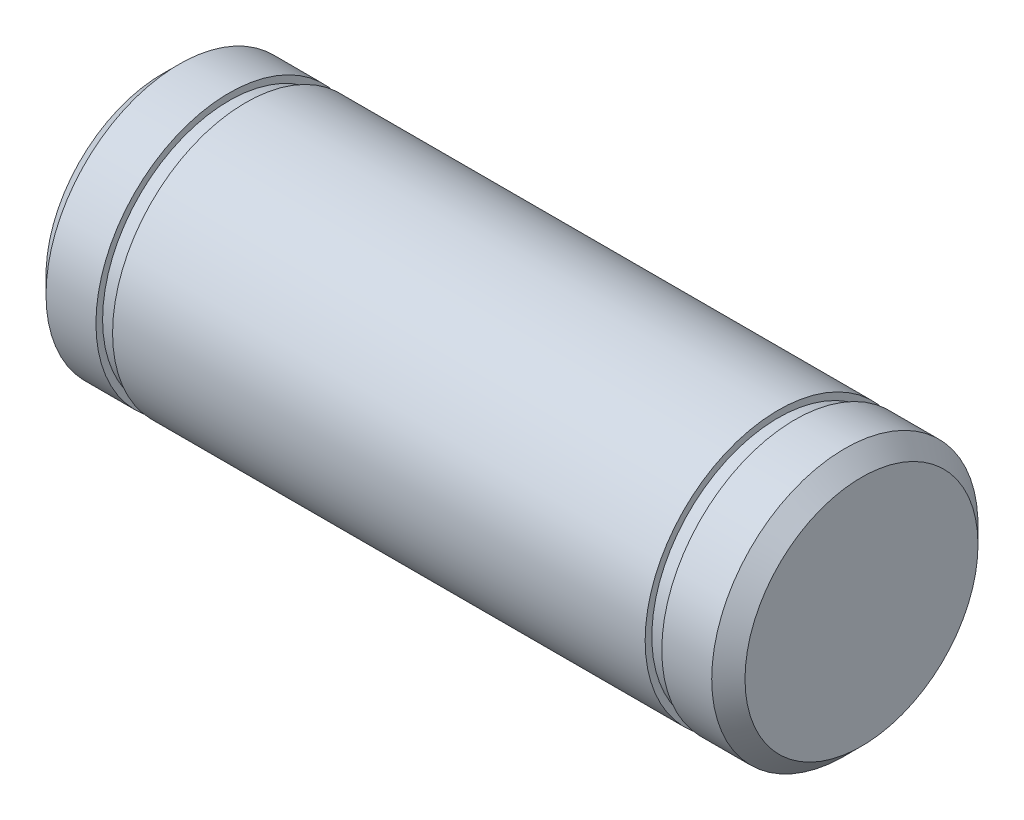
ISO-10303-21;
HEADER;
FILE_DESCRIPTION(('STEP AP214'),'2;1');
FILE_NAME('part.step','',(''),(''),'','','');
FILE_SCHEMA(('AUTOMOTIVE_DESIGN { 1 0 10303 214 1 1 1 1 }'));
ENDSEC;
DATA;
#1=APPLICATION_CONTEXT('core data for automotive mechanical design processes');
#2=APPLICATION_PROTOCOL_DEFINITION('international standard','automotive_design',2000,#1);
#3=PRODUCT_CONTEXT('',#1,'mechanical');
#4=PRODUCT('Part','Part','',(#3));
#5=PRODUCT_RELATED_PRODUCT_CATEGORY('part','',(#4));
#6=PRODUCT_DEFINITION_FORMATION('','',#4);
#7=PRODUCT_DEFINITION_CONTEXT('part definition',#1,'design');
#8=PRODUCT_DEFINITION('design','',#6,#7);
#9=PRODUCT_DEFINITION_SHAPE('','',#8);
#10=(LENGTH_UNIT() NAMED_UNIT(*) SI_UNIT(.MILLI.,.METRE.));
#11=(NAMED_UNIT(*) PLANE_ANGLE_UNIT() SI_UNIT($,.RADIAN.));
#12=(NAMED_UNIT(*) SI_UNIT($,.STERADIAN.) SOLID_ANGLE_UNIT());
#13=UNCERTAINTY_MEASURE_WITH_UNIT(LENGTH_MEASURE(1.E-05),#10,'distance_accuracy_value','');
#14=(GEOMETRIC_REPRESENTATION_CONTEXT(3) GLOBAL_UNCERTAINTY_ASSIGNED_CONTEXT((#13)) GLOBAL_UNIT_ASSIGNED_CONTEXT((#10,
#11,#12)) REPRESENTATION_CONTEXT('',''));
#15=CARTESIAN_POINT('',(0.,0.,0.));
#16=DIRECTION('',(0.,0.,1.));
#17=DIRECTION('',(1.,0.,0.));
#18=AXIS2_PLACEMENT_3D('',#15,#16,#17);
#19=CARTESIAN_POINT('',(10.5,0.,0.));
#20=DIRECTION('',(-1.,0.,0.));
#21=DIRECTION('',(0.,0.,1.));
#22=AXIS2_PLACEMENT_3D('',#19,#20,#21);
#23=CYLINDRICAL_SURFACE('',#22,2.);
#24=CARTESIAN_POINT('',(9.25,0.,0.));
#25=DIRECTION('',(1.,0.,0.));
#26=DIRECTION('',(0.,0.,-1.));
#27=AXIS2_PLACEMENT_3D('',#24,#25,#26);
#28=CIRCLE('',#27,2.);
#29=CARTESIAN_POINT('',(9.25,0.,2.));
#30=VERTEX_POINT('',#29);
#31=EDGE_CURVE('E52',#30,#30,#28,.T.);
#32=CARTESIAN_POINT('',(1.25,0.,0.));
#33=DIRECTION('',(-1.,0.,0.));
#34=DIRECTION('',(0.,0.,1.));
#35=AXIS2_PLACEMENT_3D('',#32,#33,#34);
#36=CIRCLE('',#35,2.);
#37=CARTESIAN_POINT('',(1.25,0.,2.));
#38=VERTEX_POINT('',#37);
#39=EDGE_CURVE('E53',#38,#38,#36,.T.);
#40=CARTESIAN_POINT('',(9.25,0.,2.));
#41=CARTESIAN_POINT('',(9.16666666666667,0.,2.));
#42=CARTESIAN_POINT('',(9.08333333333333,0.,2.));
#43=CARTESIAN_POINT('',(8.91666666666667,0.,2.));
#44=CARTESIAN_POINT('',(8.83333333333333,0.,2.));
#45=CARTESIAN_POINT('',(8.66666666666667,0.,2.));
#46=CARTESIAN_POINT('',(8.58333333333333,0.,2.));
#47=CARTESIAN_POINT('',(8.41666666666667,0.,2.));
#48=CARTESIAN_POINT('',(8.33333333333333,0.,2.));
#49=CARTESIAN_POINT('',(8.16666666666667,0.,2.));
#50=CARTESIAN_POINT('',(8.08333333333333,0.,2.));
#51=CARTESIAN_POINT('',(7.91666666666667,0.,2.));
#52=CARTESIAN_POINT('',(7.83333333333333,0.,2.));
#53=CARTESIAN_POINT('',(7.66666666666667,0.,2.));
#54=CARTESIAN_POINT('',(7.58333333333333,0.,2.));
#55=CARTESIAN_POINT('',(7.41666666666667,0.,2.));
#56=CARTESIAN_POINT('',(7.33333333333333,0.,2.));
#57=CARTESIAN_POINT('',(7.16666666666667,0.,2.));
#58=CARTESIAN_POINT('',(7.08333333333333,0.,2.));
#59=CARTESIAN_POINT('',(6.91666666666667,0.,2.));
#60=CARTESIAN_POINT('',(6.83333333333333,0.,2.));
#61=CARTESIAN_POINT('',(6.66666666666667,0.,2.));
#62=CARTESIAN_POINT('',(6.58333333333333,0.,2.));
#63=CARTESIAN_POINT('',(6.41666666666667,0.,2.));
#64=CARTESIAN_POINT('',(6.33333333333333,0.,2.));
#65=CARTESIAN_POINT('',(6.16666666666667,0.,2.));
#66=CARTESIAN_POINT('',(6.08333333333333,0.,2.));
#67=CARTESIAN_POINT('',(5.91666666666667,0.,2.));
#68=CARTESIAN_POINT('',(5.83333333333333,0.,2.));
#69=CARTESIAN_POINT('',(5.66666666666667,0.,2.));
#70=CARTESIAN_POINT('',(5.58333333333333,0.,2.));
#71=CARTESIAN_POINT('',(5.41666666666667,0.,2.));
#72=CARTESIAN_POINT('',(5.33333333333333,0.,2.));
#73=CARTESIAN_POINT('',(5.16666666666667,0.,2.));
#74=CARTESIAN_POINT('',(5.08333333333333,0.,2.));
#75=CARTESIAN_POINT('',(4.91666666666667,0.,2.));
#76=CARTESIAN_POINT('',(4.83333333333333,0.,2.));
#77=CARTESIAN_POINT('',(4.66666666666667,0.,2.));
#78=CARTESIAN_POINT('',(4.58333333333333,0.,2.));
#79=CARTESIAN_POINT('',(4.41666666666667,0.,2.));
#80=CARTESIAN_POINT('',(4.33333333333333,0.,2.));
#81=CARTESIAN_POINT('',(4.16666666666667,0.,2.));
#82=CARTESIAN_POINT('',(4.08333333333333,0.,2.));
#83=CARTESIAN_POINT('',(3.91666666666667,0.,2.));
#84=CARTESIAN_POINT('',(3.83333333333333,0.,2.));
#85=CARTESIAN_POINT('',(3.66666666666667,0.,2.));
#86=CARTESIAN_POINT('',(3.58333333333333,0.,2.));
#87=CARTESIAN_POINT('',(3.41666666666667,0.,2.));
#88=CARTESIAN_POINT('',(3.33333333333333,0.,2.));
#89=CARTESIAN_POINT('',(3.16666666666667,0.,2.));
#90=CARTESIAN_POINT('',(3.08333333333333,0.,2.));
#91=CARTESIAN_POINT('',(2.91666666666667,0.,2.));
#92=CARTESIAN_POINT('',(2.83333333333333,0.,2.));
#93=CARTESIAN_POINT('',(2.66666666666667,0.,2.));
#94=CARTESIAN_POINT('',(2.58333333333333,0.,2.));
#95=CARTESIAN_POINT('',(2.41666666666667,0.,2.));
#96=CARTESIAN_POINT('',(2.33333333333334,0.,2.));
#97=CARTESIAN_POINT('',(2.16666666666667,0.,2.));
#98=CARTESIAN_POINT('',(2.08333333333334,0.,2.));
#99=CARTESIAN_POINT('',(1.91666666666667,0.,2.));
#100=CARTESIAN_POINT('',(1.83333333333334,0.,2.));
#101=CARTESIAN_POINT('',(1.66666666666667,0.,2.));
#102=CARTESIAN_POINT('',(1.58333333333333,0.,2.));
#103=CARTESIAN_POINT('',(1.41666666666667,0.,2.));
#104=CARTESIAN_POINT('',(1.33333333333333,0.,2.));
#105=CARTESIAN_POINT('',(1.25,0.,2.));
#106=B_SPLINE_CURVE_WITH_KNOTS('',3,(#40,#41,#42,#43,#44,#45,#46,#47,#48,#49,#50,#51,#52,#53,
#54,#55,#56,#57,#58,#59,#60,#61,#62,#63,#64,#65,#66,#67,#68,#69,#70,#71,#72,#73,#74,#75,#76,#77,
#78,#79,#80,#81,#82,#83,#84,#85,#86,#87,#88,#89,#90,#91,#92,#93,#94,#95,#96,#97,#98,#99,#100,
#101,#102,#103,#104,#105),.UNSPECIFIED.,.F.,.F.,(4,2,2,2,2,2,2,2,2,2,2,2,2,2,2,2,2,2,2,2,2,2,2,
2,2,2,2,2,2,2,2,2,4),(0.,0.249999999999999,0.499999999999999,0.749999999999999,
0.999999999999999,1.25,1.5,1.75,2.,2.25,2.5,2.75,3.,3.25,3.5,3.75,4.,4.25,4.5,4.75,5.,5.25,5.5,
5.75,6.,6.25,6.5,6.75,7.,7.25,7.5,7.75,8.),.UNSPECIFIED.);
#107=EDGE_CURVE('BSEAM32',#30,#38,#106,.T.);
#108=ORIENTED_EDGE('',*,*,#31,.F.);
#109=ORIENTED_EDGE('',*,*,#39,.F.);
#110=ORIENTED_EDGE('',*,*,#107,.T.);
#111=ORIENTED_EDGE('',*,*,#107,.F.);
#112=EDGE_LOOP('',(#108,#110,#109,#111));
#113=FACE_BOUND('',#112,.T.);
#114=ADVANCED_FACE('F32',(#113),#23,.T.);
#115=CARTESIAN_POINT('',(9.25,0.,0.));
#116=DIRECTION('',(1.,0.,0.));
#117=DIRECTION('',(0.,0.,-1.));
#118=AXIS2_PLACEMENT_3D('',#115,#116,#117);
#119=PLANE('',#118);
#120=CARTESIAN_POINT('',(9.25,0.,0.));
#121=DIRECTION('',(1.,0.,0.));
#122=DIRECTION('',(0.,0.,-1.));
#123=AXIS2_PLACEMENT_3D('',#120,#121,#122);
#124=CIRCLE('',#123,1.9);
#125=CARTESIAN_POINT('',(9.25,0.,-1.9));
#126=VERTEX_POINT('',#125);
#127=EDGE_CURVE('E66',#126,#126,#124,.T.);
#128=ORIENTED_EDGE('',*,*,#127,.F.);
#129=EDGE_LOOP('',(#128));
#130=FACE_BOUND('',#129,.T.);
#131=ORIENTED_EDGE('',*,*,#31,.T.);
#132=EDGE_LOOP('',(#131));
#133=FACE_BOUND('',#132,.T.);
#134=ADVANCED_FACE('F89',(#130,#133),#119,.T.);
#135=CARTESIAN_POINT('',(9.5,0.,0.));
#136=DIRECTION('',(1.,0.,0.));
#137=DIRECTION('',(0.,0.,-1.));
#138=AXIS2_PLACEMENT_3D('',#135,#136,#137);
#139=PLANE('',#138);
#140=CARTESIAN_POINT('',(9.5,0.,0.));
#141=DIRECTION('',(1.,0.,0.));
#142=DIRECTION('',(0.,0.,-1.));
#143=AXIS2_PLACEMENT_3D('',#140,#141,#142);
#144=CIRCLE('',#143,1.9);
#145=CARTESIAN_POINT('',(9.5,0.,-1.9));
#146=VERTEX_POINT('',#145);
#147=EDGE_CURVE('E56',#146,#146,#144,.T.);
#148=ORIENTED_EDGE('',*,*,#147,.T.);
#149=EDGE_LOOP('',(#148));
#150=FACE_BOUND('',#149,.T.);
#151=CARTESIAN_POINT('',(9.5,0.,0.));
#152=DIRECTION('',(1.,0.,0.));
#153=DIRECTION('',(0.,0.,-1.));
#154=AXIS2_PLACEMENT_3D('',#151,#152,#153);
#155=CIRCLE('',#154,2.);
#156=CARTESIAN_POINT('',(9.5,0.,2.));
#157=VERTEX_POINT('',#156);
#158=EDGE_CURVE('E63',#157,#157,#155,.T.);
#159=ORIENTED_EDGE('',*,*,#158,.F.);
#160=EDGE_LOOP('',(#159));
#161=FACE_BOUND('',#160,.T.);
#162=ADVANCED_FACE('F96',(#150,#161),#139,.F.);
#163=CARTESIAN_POINT('',(9.25,0.,0.));
#164=DIRECTION('',(1.,0.,0.));
#165=DIRECTION('',(0.,0.,-1.));
#166=AXIS2_PLACEMENT_3D('',#163,#164,#165);
#167=CYLINDRICAL_SURFACE('',#166,1.9);
#168=ORIENTED_EDGE('',*,*,#127,.T.);
#169=EDGE_LOOP('',(#168));
#170=FACE_BOUND('',#169,.T.);
#171=ORIENTED_EDGE('',*,*,#147,.F.);
#172=EDGE_LOOP('',(#171));
#173=FACE_BOUND('',#172,.T.);
#174=ADVANCED_FACE('F110',(#170,#173),#167,.T.);
#175=CARTESIAN_POINT('',(10.5,0.,0.));
#176=DIRECTION('',(1.,0.,0.));
#177=DIRECTION('',(0.,0.,-1.));
#178=AXIS2_PLACEMENT_3D('',#175,#176,#177);
#179=PLANE('',#178);
#180=CARTESIAN_POINT('',(10.5,0.,0.));
#181=DIRECTION('',(1.,0.,0.));
#182=DIRECTION('',(0.,0.,-1.));
#183=AXIS2_PLACEMENT_3D('',#180,#181,#182);
#184=CIRCLE('',#183,1.75);
#185=CARTESIAN_POINT('',(10.5,0.,-1.75));
#186=VERTEX_POINT('',#185);
#187=EDGE_CURVE('E39',#186,#186,#184,.T.);
#188=ORIENTED_EDGE('',*,*,#187,.T.);
#189=EDGE_LOOP('',(#188));
#190=FACE_BOUND('',#189,.T.);
#191=ADVANCED_FACE('F106',(#190),#179,.T.);
#192=CARTESIAN_POINT('',(10.25,0.,0.));
#193=DIRECTION('',(1.,0.,0.));
#194=DIRECTION('',(0.,0.,-1.));
#195=AXIS2_PLACEMENT_3D('',#192,#193,#194);
#196=CIRCLE('',#195,2.);
#197=CARTESIAN_POINT('',(10.25,0.,2.));
#198=VERTEX_POINT('',#197);
#199=EDGE_CURVE('E10',#198,#198,#196,.F.);
#200=CARTESIAN_POINT('',(10.25,0.,2.));
#201=CARTESIAN_POINT('',(10.2421875,0.,2.));
#202=CARTESIAN_POINT('',(10.234375,0.,2.));
#203=CARTESIAN_POINT('',(10.21875,0.,2.));
#204=CARTESIAN_POINT('',(10.2109375,0.,2.));
#205=CARTESIAN_POINT('',(10.1953125,0.,2.));
#206=CARTESIAN_POINT('',(10.1875,0.,2.));
#207=CARTESIAN_POINT('',(10.171875,0.,2.));
#208=CARTESIAN_POINT('',(10.1640625,0.,2.));
#209=CARTESIAN_POINT('',(10.1484375,0.,2.));
#210=CARTESIAN_POINT('',(10.140625,0.,2.));
#211=CARTESIAN_POINT('',(10.125,0.,2.));
#212=CARTESIAN_POINT('',(10.1171875,0.,2.));
#213=CARTESIAN_POINT('',(10.1015625,0.,2.));
#214=CARTESIAN_POINT('',(10.09375,0.,2.));
#215=CARTESIAN_POINT('',(10.078125,0.,2.));
#216=CARTESIAN_POINT('',(10.0703125,0.,2.));
#217=CARTESIAN_POINT('',(10.0546875,0.,2.));
#218=CARTESIAN_POINT('',(10.046875,0.,2.));
#219=CARTESIAN_POINT('',(10.03125,0.,2.));
#220=CARTESIAN_POINT('',(10.0234375,0.,2.));
#221=CARTESIAN_POINT('',(10.0078125,0.,2.));
#222=CARTESIAN_POINT('',(10.,0.,2.));
#223=CARTESIAN_POINT('',(9.984375,0.,2.));
#224=CARTESIAN_POINT('',(9.9765625,0.,2.));
#225=CARTESIAN_POINT('',(9.9609375,0.,2.));
#226=CARTESIAN_POINT('',(9.953125,0.,2.));
#227=CARTESIAN_POINT('',(9.9375,0.,2.));
#228=CARTESIAN_POINT('',(9.9296875,0.,2.));
#229=CARTESIAN_POINT('',(9.9140625,0.,2.));
#230=CARTESIAN_POINT('',(9.90625,0.,2.));
#231=CARTESIAN_POINT('',(9.890625,0.,2.));
#232=CARTESIAN_POINT('',(9.8828125,0.,2.));
#233=CARTESIAN_POINT('',(9.8671875,0.,2.));
#234=CARTESIAN_POINT('',(9.859375,0.,2.));
#235=CARTESIAN_POINT('',(9.84375,0.,2.));
#236=CARTESIAN_POINT('',(9.8359375,0.,2.));
#237=CARTESIAN_POINT('',(9.8203125,0.,2.));
#238=CARTESIAN_POINT('',(9.8125,0.,2.));
#239=CARTESIAN_POINT('',(9.796875,0.,2.));
#240=CARTESIAN_POINT('',(9.7890625,0.,2.));
#241=CARTESIAN_POINT('',(9.7734375,0.,2.));
#242=CARTESIAN_POINT('',(9.765625,0.,2.));
#243=CARTESIAN_POINT('',(9.75,0.,2.));
#244=CARTESIAN_POINT('',(9.7421875,0.,2.));
#245=CARTESIAN_POINT('',(9.7265625,0.,2.));
#246=CARTESIAN_POINT('',(9.71875,0.,2.));
#247=CARTESIAN_POINT('',(9.703125,0.,2.));
#248=CARTESIAN_POINT('',(9.6953125,0.,2.));
#249=CARTESIAN_POINT('',(9.6796875,0.,2.));
#250=CARTESIAN_POINT('',(9.671875,0.,2.));
#251=CARTESIAN_POINT('',(9.65625,0.,2.));
#252=CARTESIAN_POINT('',(9.6484375,0.,2.));
#253=CARTESIAN_POINT('',(9.6328125,0.,2.));
#254=CARTESIAN_POINT('',(9.625,0.,2.));
#255=CARTESIAN_POINT('',(9.609375,0.,2.));
#256=CARTESIAN_POINT('',(9.6015625,0.,2.));
#257=CARTESIAN_POINT('',(9.5859375,0.,2.));
#258=CARTESIAN_POINT('',(9.578125,0.,2.));
#259=CARTESIAN_POINT('',(9.5625,0.,2.));
#260=CARTESIAN_POINT('',(9.5546875,0.,2.));
#261=CARTESIAN_POINT('',(9.5390625,0.,2.));
#262=CARTESIAN_POINT('',(9.53125,0.,2.));
#263=CARTESIAN_POINT('',(9.515625,0.,2.));
#264=CARTESIAN_POINT('',(9.5078125,0.,2.));
#265=CARTESIAN_POINT('',(9.5,0.,2.));
#266=B_SPLINE_CURVE_WITH_KNOTS('',3,(#200,#201,#202,#203,#204,#205,#206,#207,#208,#209,#210,
#211,#212,#213,#214,#215,#216,#217,#218,#219,#220,#221,#222,#223,#224,#225,#226,#227,#228,#229,
#230,#231,#232,#233,#234,#235,#236,#237,#238,#239,#240,#241,#242,#243,#244,#245,#246,#247,#248,
#249,#250,#251,#252,#253,#254,#255,#256,#257,#258,#259,#260,#261,#262,#263,#264,#265),
.UNSPECIFIED.,.F.,.F.,(4,2,2,2,2,2,2,2,2,2,2,2,2,2,2,2,2,2,2,2,2,2,2,2,2,2,2,2,2,2,2,2,4),(0.,
0.0234374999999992,0.046875,0.0703124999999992,0.0937500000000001,0.117187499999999,0.140625,
0.164062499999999,0.1875,0.210937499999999,0.234375,0.257812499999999,0.28125,0.304687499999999,
0.328125,0.351562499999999,0.375,0.3984375,0.421875,0.4453125,0.46875,0.4921875,0.515625,
0.5390625,0.5625,0.5859375,0.609375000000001,0.6328125,0.656250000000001,0.6796875,
0.703125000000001,0.7265625,0.750000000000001),.UNSPECIFIED.);
#267=EDGE_CURVE('BSEAM84',#198,#157,#266,.T.);
#268=ORIENTED_EDGE('',*,*,#199,.T.);
#269=ORIENTED_EDGE('',*,*,#158,.T.);
#270=ORIENTED_EDGE('',*,*,#267,.T.);
#271=ORIENTED_EDGE('',*,*,#267,.F.);
#272=EDGE_LOOP('',(#268,#270,#269,#271));
#273=FACE_BOUND('',#272,.T.);
#274=ADVANCED_FACE('F84',(#273),#23,.T.);
#275=CARTESIAN_POINT('',(1.25,0.,0.));
#276=DIRECTION('',(-1.,0.,0.));
#277=DIRECTION('',(0.,0.,1.));
#278=AXIS2_PLACEMENT_3D('',#275,#276,#277);
#279=PLANE('',#278);
#280=CARTESIAN_POINT('',(1.25,0.,0.));
#281=DIRECTION('',(-1.,0.,0.));
#282=DIRECTION('',(0.,0.,1.));
#283=AXIS2_PLACEMENT_3D('',#280,#281,#282);
#284=CIRCLE('',#283,1.9);
#285=CARTESIAN_POINT('',(1.25,0.,1.9));
#286=VERTEX_POINT('',#285);
#287=EDGE_CURVE('E60',#286,#286,#284,.T.);
#288=ORIENTED_EDGE('',*,*,#287,.F.);
#289=EDGE_LOOP('',(#288));
#290=FACE_BOUND('',#289,.T.);
#291=ORIENTED_EDGE('',*,*,#39,.T.);
#292=EDGE_LOOP('',(#291));
#293=FACE_BOUND('',#292,.T.);
#294=ADVANCED_FACE('F80',(#290,#293),#279,.T.);
#295=CARTESIAN_POINT('',(1.,0.,0.));
#296=DIRECTION('',(-1.,0.,0.));
#297=DIRECTION('',(0.,0.,1.));
#298=AXIS2_PLACEMENT_3D('',#295,#296,#297);
#299=PLANE('',#298);
#300=CARTESIAN_POINT('',(1.,0.,0.));
#301=DIRECTION('',(-1.,0.,0.));
#302=DIRECTION('',(0.,0.,1.));
#303=AXIS2_PLACEMENT_3D('',#300,#301,#302);
#304=CIRCLE('',#303,1.9);
#305=CARTESIAN_POINT('',(1.,0.,1.9));
#306=VERTEX_POINT('',#305);
#307=EDGE_CURVE('E71',#306,#306,#304,.T.);
#308=ORIENTED_EDGE('',*,*,#307,.T.);
#309=EDGE_LOOP('',(#308));
#310=FACE_BOUND('',#309,.T.);
#311=CARTESIAN_POINT('',(0.999999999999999,0.,0.));
#312=DIRECTION('',(-1.,0.,0.));
#313=DIRECTION('',(0.,0.,1.));
#314=AXIS2_PLACEMENT_3D('',#311,#312,#313);
#315=CIRCLE('',#314,2.);
#316=CARTESIAN_POINT('',(1.,0.,2.));
#317=VERTEX_POINT('',#316);
#318=EDGE_CURVE('E57',#317,#317,#315,.T.);
#319=ORIENTED_EDGE('',*,*,#318,.F.);
#320=EDGE_LOOP('',(#319));
#321=FACE_BOUND('',#320,.T.);
#322=ADVANCED_FACE('F83',(#310,#321),#299,.F.);
#323=CARTESIAN_POINT('',(1.25,0.,0.));
#324=DIRECTION('',(-1.,0.,0.));
#325=DIRECTION('',(0.,0.,1.));
#326=AXIS2_PLACEMENT_3D('',#323,#324,#325);
#327=CYLINDRICAL_SURFACE('',#326,1.9);
#328=ORIENTED_EDGE('',*,*,#287,.T.);
#329=EDGE_LOOP('',(#328));
#330=FACE_BOUND('',#329,.T.);
#331=ORIENTED_EDGE('',*,*,#307,.F.);
#332=EDGE_LOOP('',(#331));
#333=FACE_BOUND('',#332,.T.);
#334=ADVANCED_FACE('F77',(#330,#333),#327,.T.);
#335=CARTESIAN_POINT('',(0.,0.,0.));
#336=DIRECTION('',(1.,0.,0.));
#337=DIRECTION('',(0.,0.,-1.));
#338=AXIS2_PLACEMENT_3D('',#335,#336,#337);
#339=PLANE('',#338);
#340=CARTESIAN_POINT('',(0.,0.,0.));
#341=DIRECTION('',(1.,0.,0.));
#342=DIRECTION('',(0.,0.,-1.));
#343=AXIS2_PLACEMENT_3D('',#340,#341,#342);
#344=CIRCLE('',#343,1.74999999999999);
#345=CARTESIAN_POINT('',(0.,0.,-1.74999999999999));
#346=VERTEX_POINT('',#345);
#347=EDGE_CURVE('E43',#346,#346,#344,.F.);
#348=ORIENTED_EDGE('',*,*,#347,.T.);
#349=EDGE_LOOP('',(#348));
#350=FACE_BOUND('',#349,.T.);
#351=ADVANCED_FACE('F103',(#350),#339,.F.);
#352=CARTESIAN_POINT('',(0.250000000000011,0.,0.));
#353=DIRECTION('',(1.,0.,0.));
#354=DIRECTION('',(0.,0.,-1.));
#355=AXIS2_PLACEMENT_3D('',#352,#353,#354);
#356=CIRCLE('',#355,2.);
#357=CARTESIAN_POINT('',(0.250000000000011,0.,2.));
#358=VERTEX_POINT('',#357);
#359=EDGE_CURVE('E47',#358,#358,#356,.T.);
#360=CARTESIAN_POINT('',(0.250000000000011,0.,2.));
#361=CARTESIAN_POINT('',(0.25781250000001,0.,2.));
#362=CARTESIAN_POINT('',(0.26562500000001,0.,2.));
#363=CARTESIAN_POINT('',(0.28125000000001,0.,2.));
#364=CARTESIAN_POINT('',(0.28906250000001,0.,2.));
#365=CARTESIAN_POINT('',(0.30468750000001,0.,2.));
#366=CARTESIAN_POINT('',(0.31250000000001,0.,2.));
#367=CARTESIAN_POINT('',(0.32812500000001,0.,2.));
#368=CARTESIAN_POINT('',(0.335937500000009,0.,2.));
#369=CARTESIAN_POINT('',(0.351562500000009,0.,2.));
#370=CARTESIAN_POINT('',(0.35937500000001,0.,2.));
#371=CARTESIAN_POINT('',(0.37500000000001,0.,2.));
#372=CARTESIAN_POINT('',(0.382812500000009,0.,2.));
#373=CARTESIAN_POINT('',(0.398437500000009,0.,2.));
#374=CARTESIAN_POINT('',(0.406250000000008,0.,2.));
#375=CARTESIAN_POINT('',(0.421875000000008,0.,2.));
#376=CARTESIAN_POINT('',(0.429687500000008,0.,2.));
#377=CARTESIAN_POINT('',(0.445312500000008,0.,2.));
#378=CARTESIAN_POINT('',(0.453125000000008,0.,2.));
#379=CARTESIAN_POINT('',(0.468750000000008,0.,2.));
#380=CARTESIAN_POINT('',(0.476562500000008,0.,2.));
#381=CARTESIAN_POINT('',(0.492187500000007,0.,2.));
#382=CARTESIAN_POINT('',(0.500000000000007,0.,2.));
#383=CARTESIAN_POINT('',(0.515625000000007,0.,2.));
#384=CARTESIAN_POINT('',(0.523437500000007,0.,2.));
#385=CARTESIAN_POINT('',(0.539062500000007,0.,2.));
#386=CARTESIAN_POINT('',(0.546875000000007,0.,2.));
#387=CARTESIAN_POINT('',(0.562500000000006,0.,2.));
#388=CARTESIAN_POINT('',(0.570312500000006,0.,2.));
#389=CARTESIAN_POINT('',(0.585937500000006,0.,2.));
#390=CARTESIAN_POINT('',(0.593750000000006,0.,2.));
#391=CARTESIAN_POINT('',(0.609375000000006,0.,2.));
#392=CARTESIAN_POINT('',(0.617187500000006,0.,2.));
#393=CARTESIAN_POINT('',(0.632812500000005,0.,2.));
#394=CARTESIAN_POINT('',(0.640625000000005,0.,2.));
#395=CARTESIAN_POINT('',(0.656250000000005,0.,2.));
#396=CARTESIAN_POINT('',(0.664062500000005,0.,2.));
#397=CARTESIAN_POINT('',(0.679687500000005,0.,2.));
#398=CARTESIAN_POINT('',(0.687500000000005,0.,2.));
#399=CARTESIAN_POINT('',(0.703125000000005,0.,2.));
#400=CARTESIAN_POINT('',(0.710937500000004,0.,2.));
#401=CARTESIAN_POINT('',(0.726562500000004,0.,2.));
#402=CARTESIAN_POINT('',(0.734375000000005,0.,2.));
#403=CARTESIAN_POINT('',(0.750000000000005,0.,2.));
#404=CARTESIAN_POINT('',(0.757812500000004,0.,2.));
#405=CARTESIAN_POINT('',(0.773437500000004,0.,2.));
#406=CARTESIAN_POINT('',(0.781250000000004,0.,2.));
#407=CARTESIAN_POINT('',(0.796875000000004,0.,2.));
#408=CARTESIAN_POINT('',(0.804687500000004,0.,2.));
#409=CARTESIAN_POINT('',(0.820312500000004,0.,2.));
#410=CARTESIAN_POINT('',(0.828125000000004,0.,2.));
#411=CARTESIAN_POINT('',(0.843750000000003,0.,2.));
#412=CARTESIAN_POINT('',(0.851562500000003,0.,2.));
#413=CARTESIAN_POINT('',(0.867187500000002,0.,2.));
#414=CARTESIAN_POINT('',(0.875000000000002,0.,2.));
#415=CARTESIAN_POINT('',(0.890625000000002,0.,2.));
#416=CARTESIAN_POINT('',(0.898437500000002,0.,2.));
#417=CARTESIAN_POINT('',(0.914062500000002,0.,2.));
#418=CARTESIAN_POINT('',(0.921875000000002,0.,2.));
#419=CARTESIAN_POINT('',(0.937500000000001,0.,2.));
#420=CARTESIAN_POINT('',(0.945312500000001,0.,2.));
#421=CARTESIAN_POINT('',(0.960937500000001,0.,2.));
#422=CARTESIAN_POINT('',(0.968750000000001,0.,2.));
#423=CARTESIAN_POINT('',(0.984375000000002,0.,2.));
#424=CARTESIAN_POINT('',(0.992187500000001,0.,2.));
#425=CARTESIAN_POINT('',(1.,0.,2.));
#426=B_SPLINE_CURVE_WITH_KNOTS('',3,(#360,#361,#362,#363,#364,#365,#366,#367,#368,#369,#370,
#371,#372,#373,#374,#375,#376,#377,#378,#379,#380,#381,#382,#383,#384,#385,#386,#387,#388,#389,
#390,#391,#392,#393,#394,#395,#396,#397,#398,#399,#400,#401,#402,#403,#404,#405,#406,#407,#408,
#409,#410,#411,#412,#413,#414,#415,#416,#417,#418,#419,#420,#421,#422,#423,#424,#425),
.UNSPECIFIED.,.F.,.F.,(4,2,2,2,2,2,2,2,2,2,2,2,2,2,2,2,2,2,2,2,2,2,2,2,2,2,2,2,2,2,2,2,4),(0.,
0.0234374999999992,0.046875,0.0703124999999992,0.0937499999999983,0.117187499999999,
0.140624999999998,0.164062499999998,0.187499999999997,0.210937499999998,0.234374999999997,
0.257812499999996,0.281249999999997,0.304687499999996,0.328124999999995,0.351562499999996,
0.374999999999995,0.398437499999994,0.421874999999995,0.445312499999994,0.468749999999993,
0.492187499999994,0.515624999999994,0.539062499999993,0.562499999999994,0.585937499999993,
0.609374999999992,0.632812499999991,0.656249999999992,0.679687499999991,0.70312499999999,
0.726562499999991,0.74999999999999),.UNSPECIFIED.);
#427=EDGE_CURVE('BSEAM92',#358,#317,#426,.T.);
#428=ORIENTED_EDGE('',*,*,#359,.T.);
#429=ORIENTED_EDGE('',*,*,#318,.T.);
#430=ORIENTED_EDGE('',*,*,#427,.T.);
#431=ORIENTED_EDGE('',*,*,#427,.F.);
#432=EDGE_LOOP('',(#428,#430,#429,#431));
#433=FACE_BOUND('',#432,.T.);
#434=ADVANCED_FACE('F92',(#433),#23,.T.);
#435=CARTESIAN_POINT('',(0.250000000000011,0.,0.));
#436=DIRECTION('',(1.,0.,0.));
#437=DIRECTION('',(0.,0.,-1.));
#438=AXIS2_PLACEMENT_3D('',#435,#436,#437);
#439=CONICAL_SURFACE('',#438,2.,0.785398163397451);
#440=ORIENTED_EDGE('',*,*,#347,.F.);
#441=EDGE_LOOP('',(#440));
#442=FACE_BOUND('',#441,.T.);
#443=ORIENTED_EDGE('',*,*,#359,.F.);
#444=EDGE_LOOP('',(#443));
#445=FACE_BOUND('',#444,.T.);
#446=ADVANCED_FACE('F102',(#442,#445),#439,.T.);
#447=CARTESIAN_POINT('',(10.5,0.,0.));
#448=DIRECTION('',(-1.,0.,0.));
#449=DIRECTION('',(0.,0.,1.));
#450=AXIS2_PLACEMENT_3D('',#447,#448,#449);
#451=CONICAL_SURFACE('',#450,1.75,0.785398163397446);
#452=ORIENTED_EDGE('',*,*,#199,.F.);
#453=EDGE_LOOP('',(#452));
#454=FACE_BOUND('',#453,.T.);
#455=ORIENTED_EDGE('',*,*,#187,.F.);
#456=EDGE_LOOP('',(#455));
#457=FACE_BOUND('',#456,.T.);
#458=ADVANCED_FACE('F34',(#454,#457),#451,.T.);
#459=CLOSED_SHELL('',(#114,#134,#162,#174,#191,#274,#294,#322,#334,#351,#434,#446,#458));
#460=MANIFOLD_SOLID_BREP('B2',#459);
#461=ADVANCED_BREP_SHAPE_REPRESENTATION('',(#18,#460),#14);
#462=SHAPE_DEFINITION_REPRESENTATION(#9,#461);
ENDSEC;
END-ISO-10303-21;
